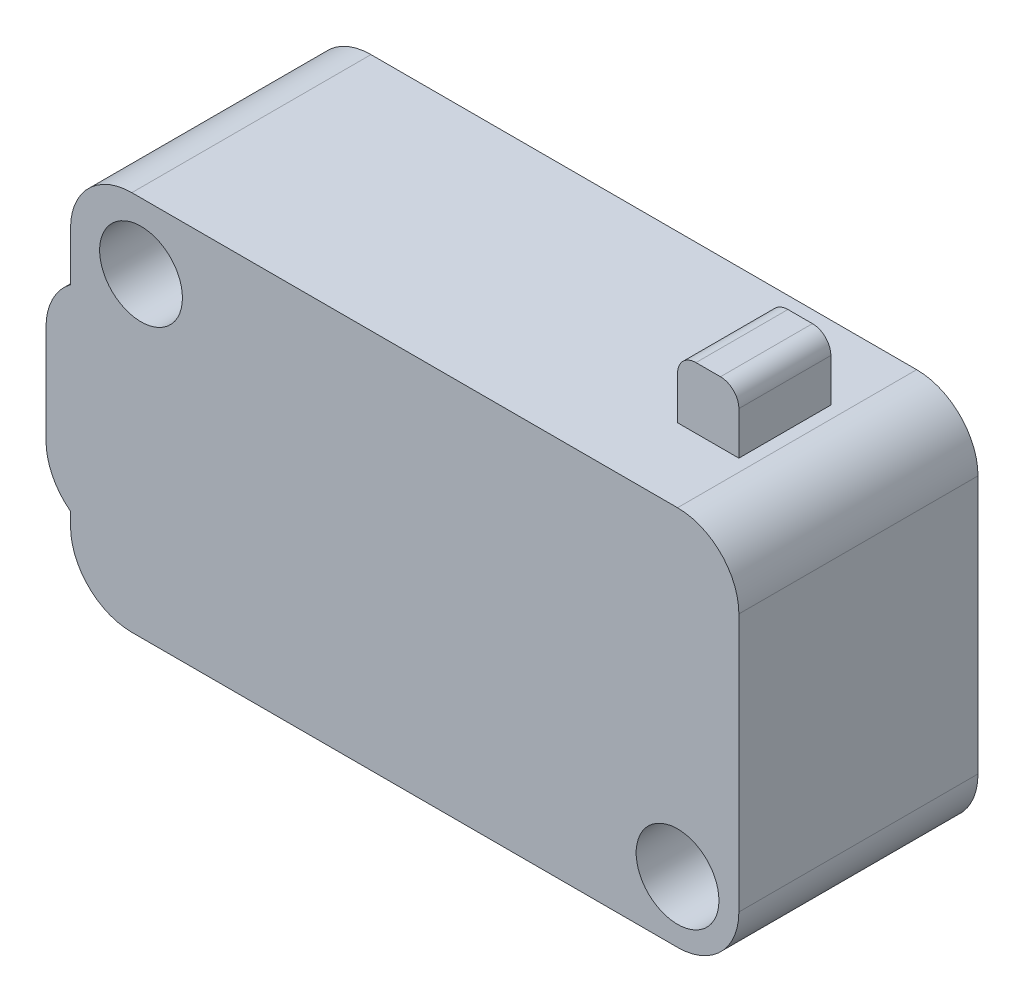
ISO-10303-21;
HEADER;
FILE_DESCRIPTION(('STEP AP214'),'2;1');
FILE_NAME('part.step','',(''),(''),'','','');
FILE_SCHEMA(('AUTOMOTIVE_DESIGN { 1 0 10303 214 1 1 1 1 }'));
ENDSEC;
DATA;
#1=APPLICATION_CONTEXT('core data for automotive mechanical design processes');
#2=APPLICATION_PROTOCOL_DEFINITION('international standard','automotive_design',2000,#1);
#3=PRODUCT_CONTEXT('',#1,'mechanical');
#4=PRODUCT('Part','Part','',(#3));
#5=PRODUCT_RELATED_PRODUCT_CATEGORY('part','',(#4));
#6=PRODUCT_DEFINITION_FORMATION('','',#4);
#7=PRODUCT_DEFINITION_CONTEXT('part definition',#1,'design');
#8=PRODUCT_DEFINITION('design','',#6,#7);
#9=PRODUCT_DEFINITION_SHAPE('','',#8);
#10=(LENGTH_UNIT() NAMED_UNIT(*) SI_UNIT(.MILLI.,.METRE.));
#11=(NAMED_UNIT(*) PLANE_ANGLE_UNIT() SI_UNIT($,.RADIAN.));
#12=(NAMED_UNIT(*) SI_UNIT($,.STERADIAN.) SOLID_ANGLE_UNIT());
#13=UNCERTAINTY_MEASURE_WITH_UNIT(LENGTH_MEASURE(1.E-05),#10,'distance_accuracy_value','');
#14=(GEOMETRIC_REPRESENTATION_CONTEXT(3) GLOBAL_UNCERTAINTY_ASSIGNED_CONTEXT((#13)) GLOBAL_UNIT_ASSIGNED_CONTEXT((#10,
#11,#12)) REPRESENTATION_CONTEXT('',''));
#15=CARTESIAN_POINT('',(0.,0.,0.));
#16=DIRECTION('',(0.,0.,1.));
#17=DIRECTION('',(1.,0.,0.));
#18=AXIS2_PLACEMENT_3D('',#15,#16,#17);
#19=CARTESIAN_POINT('',(0.,15.7734,9.906));
#20=DIRECTION('',(0.,-1.,0.));
#21=DIRECTION('',(0.,0.,-1.));
#22=AXIS2_PLACEMENT_3D('',#19,#20,#21);
#23=PLANE('',#22);
#24=DIRECTION('',(-1.,0.,0.));
#25=VECTOR('',#24,1.);
#26=CARTESIAN_POINT('',(0.,15.7734,0.));
#27=LINE('',#26,#25);
#28=CARTESIAN_POINT('',(25.146,15.7734,0.));
#29=VERTEX_POINT('',#28);
#30=CARTESIAN_POINT('',(2.54,15.7734,0.));
#31=VERTEX_POINT('',#30);
#32=EDGE_CURVE('E211',#29,#31,#27,.T.);
#33=ORIENTED_EDGE('',*,*,#32,.T.);
#34=DIRECTION('',(0.,0.,-1.));
#35=VECTOR('',#34,1.);
#36=CARTESIAN_POINT('',(2.54,15.7734,9.906));
#37=LINE('',#36,#35);
#38=CARTESIAN_POINT('',(2.54,15.7734,9.906));
#39=VERTEX_POINT('',#38);
#40=EDGE_CURVE('E261',#31,#39,#37,.F.);
#41=ORIENTED_EDGE('',*,*,#40,.T.);
#42=DIRECTION('',(-1.,0.,0.));
#43=VECTOR('',#42,1.);
#44=CARTESIAN_POINT('',(0.,15.7734,9.906));
#45=LINE('',#44,#43);
#46=CARTESIAN_POINT('',(25.146,15.7734,9.906));
#47=VERTEX_POINT('',#46);
#48=EDGE_CURVE('E229',#47,#39,#45,.T.);
#49=ORIENTED_EDGE('',*,*,#48,.F.);
#50=DIRECTION('',(0.,0.,-1.));
#51=VECTOR('',#50,1.);
#52=CARTESIAN_POINT('',(25.146,15.7734,9.906));
#53=LINE('',#52,#51);
#54=EDGE_CURVE('E258',#47,#29,#53,.T.);
#55=ORIENTED_EDGE('',*,*,#54,.T.);
#56=EDGE_LOOP('',(#33,#41,#49,#55));
#57=FACE_BOUND('',#56,.T.);
#58=DIRECTION('',(0.,0.,1.));
#59=VECTOR('',#58,1.);
#60=CARTESIAN_POINT('',(22.098,15.7734,3.048));
#61=LINE('',#60,#59);
#62=CARTESIAN_POINT('',(22.098,15.7734,3.048));
#63=VERTEX_POINT('',#62);
#64=CARTESIAN_POINT('',(22.098,15.7734,6.858));
#65=VERTEX_POINT('',#64);
#66=EDGE_CURVE('E175',#63,#65,#61,.T.);
#67=ORIENTED_EDGE('',*,*,#66,.F.);
#68=DIRECTION('',(-1.,0.,0.));
#69=VECTOR('',#68,1.);
#70=CARTESIAN_POINT('',(22.098,15.7734,3.048));
#71=LINE('',#70,#69);
#72=CARTESIAN_POINT('',(24.638,15.7734,3.048));
#73=VERTEX_POINT('',#72);
#74=EDGE_CURVE('E171',#73,#63,#71,.T.);
#75=ORIENTED_EDGE('',*,*,#74,.F.);
#76=DIRECTION('',(0.,0.,-1.));
#77=VECTOR('',#76,1.);
#78=CARTESIAN_POINT('',(24.638,15.7734,3.048));
#79=LINE('',#78,#77);
#80=CARTESIAN_POINT('',(24.638,15.7734,6.858));
#81=VERTEX_POINT('',#80);
#82=EDGE_CURVE('E156',#81,#73,#79,.T.);
#83=ORIENTED_EDGE('',*,*,#82,.F.);
#84=DIRECTION('',(1.,0.,0.));
#85=VECTOR('',#84,1.);
#86=CARTESIAN_POINT('',(22.098,15.7734,6.858));
#87=LINE('',#86,#85);
#88=EDGE_CURVE('E168',#65,#81,#87,.T.);
#89=ORIENTED_EDGE('',*,*,#88,.F.);
#90=EDGE_LOOP('',(#67,#75,#83,#89));
#91=FACE_BOUND('',#90,.T.);
#92=ADVANCED_FACE('F28',(#57,#91),#23,.F.);
#93=CARTESIAN_POINT('',(0.,3.0734,9.906));
#94=DIRECTION('',(0.,0.,-1.));
#95=DIRECTION('',(-1.,0.,0.));
#96=AXIS2_PLACEMENT_3D('',#93,#94,#95);
#97=PLANE('',#96);
#98=CARTESIAN_POINT('',(25.146,2.54,9.906));
#99=DIRECTION('',(0.,0.,1.));
#100=DIRECTION('',(1.,0.,0.));
#101=AXIS2_PLACEMENT_3D('',#98,#99,#100);
#102=CIRCLE('',#101,1.7145);
#103=CARTESIAN_POINT('',(26.8605,2.54,9.906));
#104=VERTEX_POINT('',#103);
#105=EDGE_CURVE('E199',#104,#104,#102,.T.);
#106=ORIENTED_EDGE('',*,*,#105,.F.);
#107=EDGE_LOOP('',(#106));
#108=FACE_BOUND('',#107,.T.);
#109=ORIENTED_EDGE('',*,*,#48,.T.);
#110=CARTESIAN_POINT('',(2.54,13.2334,9.906));
#111=DIRECTION('',(0.,0.,-1.));
#112=DIRECTION('',(-1.,0.,0.));
#113=AXIS2_PLACEMENT_3D('',#110,#111,#112);
#114=CIRCLE('',#113,2.54);
#115=CARTESIAN_POINT('',(0.,13.2334,9.906));
#116=VERTEX_POINT('',#115);
#117=EDGE_CURVE('E273',#39,#116,#114,.F.);
#118=ORIENTED_EDGE('',*,*,#117,.T.);
#119=DIRECTION('',(0.,-1.,0.));
#120=VECTOR('',#119,1.);
#121=CARTESIAN_POINT('',(0.,11.2014,9.906));
#122=LINE('',#121,#120);
#123=CARTESIAN_POINT('',(0.,11.2014,9.906));
#124=VERTEX_POINT('',#123);
#125=EDGE_CURVE('E232',#116,#124,#122,.T.);
#126=ORIENTED_EDGE('',*,*,#125,.T.);
#127=CARTESIAN_POINT('',(1.52400000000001,9.16940000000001,9.906));
#128=DIRECTION('',(0.,0.,-1.));
#129=DIRECTION('',(-1.,0.,0.));
#130=AXIS2_PLACEMENT_3D('',#127,#128,#129);
#131=CIRCLE('',#130,2.54);
#132=CARTESIAN_POINT('',(-1.01599999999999,9.16940000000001,9.906));
#133=VERTEX_POINT('',#132);
#134=EDGE_CURVE('E263',#124,#133,#131,.F.);
#135=ORIENTED_EDGE('',*,*,#134,.T.);
#136=DIRECTION('',(0.,-1.,0.));
#137=VECTOR('',#136,1.);
#138=CARTESIAN_POINT('',(-1.01599999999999,11.2014,9.906));
#139=LINE('',#138,#137);
#140=CARTESIAN_POINT('',(-1.01599999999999,5.10539999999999,9.906));
#141=VERTEX_POINT('',#140);
#142=EDGE_CURVE('E234',#133,#141,#139,.T.);
#143=ORIENTED_EDGE('',*,*,#142,.T.);
#144=CARTESIAN_POINT('',(1.52400000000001,5.10539999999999,9.906));
#145=DIRECTION('',(0.,0.,-1.));
#146=DIRECTION('',(-1.,0.,0.));
#147=AXIS2_PLACEMENT_3D('',#144,#145,#146);
#148=CIRCLE('',#147,2.54);
#149=CARTESIAN_POINT('',(0.,3.0734,9.906));
#150=VERTEX_POINT('',#149);
#151=EDGE_CURVE('E265',#141,#150,#148,.F.);
#152=ORIENTED_EDGE('',*,*,#151,.T.);
#153=DIRECTION('',(0.,-1.,0.));
#154=VECTOR('',#153,1.);
#155=CARTESIAN_POINT('',(0.,0.,9.906));
#156=LINE('',#155,#154);
#157=CARTESIAN_POINT('',(0.,2.54,9.906));
#158=VERTEX_POINT('',#157);
#159=EDGE_CURVE('E220',#150,#158,#156,.T.);
#160=ORIENTED_EDGE('',*,*,#159,.T.);
#161=CARTESIAN_POINT('',(2.54,2.54,9.906));
#162=DIRECTION('',(0.,0.,-1.));
#163=DIRECTION('',(-1.,0.,0.));
#164=AXIS2_PLACEMENT_3D('',#161,#162,#163);
#165=CIRCLE('',#164,2.54);
#166=CARTESIAN_POINT('',(2.54,0.,9.906));
#167=VERTEX_POINT('',#166);
#168=EDGE_CURVE('E267',#158,#167,#165,.F.);
#169=ORIENTED_EDGE('',*,*,#168,.T.);
#170=DIRECTION('',(1.,0.,0.));
#171=VECTOR('',#170,1.);
#172=CARTESIAN_POINT('',(0.,0.,9.906));
#173=LINE('',#172,#171);
#174=CARTESIAN_POINT('',(25.146,0.,9.906));
#175=VERTEX_POINT('',#174);
#176=EDGE_CURVE('E223',#167,#175,#173,.T.);
#177=ORIENTED_EDGE('',*,*,#176,.T.);
#178=CARTESIAN_POINT('',(25.146,2.54,9.906));
#179=DIRECTION('',(0.,0.,-1.));
#180=DIRECTION('',(-1.,0.,0.));
#181=AXIS2_PLACEMENT_3D('',#178,#179,#180);
#182=CIRCLE('',#181,2.54);
#183=CARTESIAN_POINT('',(27.686,2.54,9.906));
#184=VERTEX_POINT('',#183);
#185=EDGE_CURVE('E269',#175,#184,#182,.F.);
#186=ORIENTED_EDGE('',*,*,#185,.T.);
#187=DIRECTION('',(0.,1.,0.));
#188=VECTOR('',#187,1.);
#189=CARTESIAN_POINT('',(27.686,0.,9.906));
#190=LINE('',#189,#188);
#191=CARTESIAN_POINT('',(27.686,13.2334,9.906));
#192=VERTEX_POINT('',#191);
#193=EDGE_CURVE('E226',#184,#192,#190,.T.);
#194=ORIENTED_EDGE('',*,*,#193,.T.);
#195=CARTESIAN_POINT('',(25.146,13.2334,9.906));
#196=DIRECTION('',(0.,0.,-1.));
#197=DIRECTION('',(-1.,0.,0.));
#198=AXIS2_PLACEMENT_3D('',#195,#196,#197);
#199=CIRCLE('',#198,2.54);
#200=EDGE_CURVE('E271',#192,#47,#199,.F.);
#201=ORIENTED_EDGE('',*,*,#200,.T.);
#202=EDGE_LOOP('',(#109,#118,#126,#135,#143,#152,#160,#169,#177,#186,#194,#201));
#203=FACE_BOUND('',#202,.T.);
#204=CARTESIAN_POINT('',(2.92100000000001,13.0429,9.906));
#205=DIRECTION('',(0.,0.,1.));
#206=DIRECTION('',(1.,0.,0.));
#207=AXIS2_PLACEMENT_3D('',#204,#205,#206);
#208=CIRCLE('',#207,1.7145);
#209=CARTESIAN_POINT('',(4.6355,13.0429,9.906));
#210=VERTEX_POINT('',#209);
#211=EDGE_CURVE('E193',#210,#210,#208,.T.);
#212=ORIENTED_EDGE('',*,*,#211,.F.);
#213=EDGE_LOOP('',(#212));
#214=FACE_BOUND('',#213,.T.);
#215=ADVANCED_FACE('F321',(#108,#203,#214),#97,.F.);
#216=CARTESIAN_POINT('',(0.,3.0734,0.));
#217=DIRECTION('',(0.,0.,-1.));
#218=DIRECTION('',(-1.,0.,0.));
#219=AXIS2_PLACEMENT_3D('',#216,#217,#218);
#220=PLANE('',#219);
#221=CARTESIAN_POINT('',(25.146,2.54,0.));
#222=DIRECTION('',(0.,0.,1.));
#223=DIRECTION('',(1.,0.,0.));
#224=AXIS2_PLACEMENT_3D('',#221,#222,#223);
#225=CIRCLE('',#224,1.7145);
#226=CARTESIAN_POINT('',(26.8605,2.54,0.));
#227=VERTEX_POINT('',#226);
#228=EDGE_CURVE('E196',#227,#227,#225,.T.);
#229=ORIENTED_EDGE('',*,*,#228,.T.);
#230=EDGE_LOOP('',(#229));
#231=FACE_BOUND('',#230,.T.);
#232=DIRECTION('',(0.,-1.,0.));
#233=VECTOR('',#232,1.);
#234=CARTESIAN_POINT('',(0.,11.2014,0.));
#235=LINE('',#234,#233);
#236=CARTESIAN_POINT('',(0.,13.2334,0.));
#237=VERTEX_POINT('',#236);
#238=CARTESIAN_POINT('',(0.,11.2014,0.));
#239=VERTEX_POINT('',#238);
#240=EDGE_CURVE('E214',#237,#239,#235,.T.);
#241=ORIENTED_EDGE('',*,*,#240,.F.);
#242=CARTESIAN_POINT('',(2.54,13.2334,0.));
#243=DIRECTION('',(0.,0.,-1.));
#244=DIRECTION('',(-1.,0.,0.));
#245=AXIS2_PLACEMENT_3D('',#242,#243,#244);
#246=CIRCLE('',#245,2.54);
#247=EDGE_CURVE('E256',#237,#31,#246,.T.);
#248=ORIENTED_EDGE('',*,*,#247,.T.);
#249=ORIENTED_EDGE('',*,*,#32,.F.);
#250=CARTESIAN_POINT('',(25.146,13.2334,0.));
#251=DIRECTION('',(0.,0.,-1.));
#252=DIRECTION('',(-1.,0.,0.));
#253=AXIS2_PLACEMENT_3D('',#250,#251,#252);
#254=CIRCLE('',#253,2.54);
#255=CARTESIAN_POINT('',(27.686,13.2334,0.));
#256=VERTEX_POINT('',#255);
#257=EDGE_CURVE('E254',#29,#256,#254,.T.);
#258=ORIENTED_EDGE('',*,*,#257,.T.);
#259=DIRECTION('',(0.,1.,0.));
#260=VECTOR('',#259,1.);
#261=CARTESIAN_POINT('',(27.686,0.,0.));
#262=LINE('',#261,#260);
#263=CARTESIAN_POINT('',(27.686,2.54,0.));
#264=VERTEX_POINT('',#263);
#265=EDGE_CURVE('E208',#264,#256,#262,.T.);
#266=ORIENTED_EDGE('',*,*,#265,.F.);
#267=CARTESIAN_POINT('',(25.146,2.54,0.));
#268=DIRECTION('',(0.,0.,-1.));
#269=DIRECTION('',(-1.,0.,0.));
#270=AXIS2_PLACEMENT_3D('',#267,#268,#269);
#271=CIRCLE('',#270,2.54);
#272=CARTESIAN_POINT('',(25.146,0.,0.));
#273=VERTEX_POINT('',#272);
#274=EDGE_CURVE('E252',#264,#273,#271,.T.);
#275=ORIENTED_EDGE('',*,*,#274,.T.);
#276=DIRECTION('',(1.,0.,0.));
#277=VECTOR('',#276,1.);
#278=CARTESIAN_POINT('',(0.,0.,0.));
#279=LINE('',#278,#277);
#280=CARTESIAN_POINT('',(2.54,0.,0.));
#281=VERTEX_POINT('',#280);
#282=EDGE_CURVE('E205',#281,#273,#279,.T.);
#283=ORIENTED_EDGE('',*,*,#282,.F.);
#284=CARTESIAN_POINT('',(2.54,2.54,0.));
#285=DIRECTION('',(0.,0.,-1.));
#286=DIRECTION('',(-1.,0.,0.));
#287=AXIS2_PLACEMENT_3D('',#284,#285,#286);
#288=CIRCLE('',#287,2.54);
#289=CARTESIAN_POINT('',(0.,2.54,0.));
#290=VERTEX_POINT('',#289);
#291=EDGE_CURVE('E250',#281,#290,#288,.T.);
#292=ORIENTED_EDGE('',*,*,#291,.T.);
#293=DIRECTION('',(0.,-1.,0.));
#294=VECTOR('',#293,1.);
#295=CARTESIAN_POINT('',(0.,0.,0.));
#296=LINE('',#295,#294);
#297=CARTESIAN_POINT('',(0.,3.0734,0.));
#298=VERTEX_POINT('',#297);
#299=EDGE_CURVE('E202',#298,#290,#296,.T.);
#300=ORIENTED_EDGE('',*,*,#299,.F.);
#301=CARTESIAN_POINT('',(1.52400000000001,5.10539999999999,0.));
#302=DIRECTION('',(0.,0.,-1.));
#303=DIRECTION('',(-1.,0.,0.));
#304=AXIS2_PLACEMENT_3D('',#301,#302,#303);
#305=CIRCLE('',#304,2.54);
#306=CARTESIAN_POINT('',(-1.01599999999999,5.10539999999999,0.));
#307=VERTEX_POINT('',#306);
#308=EDGE_CURVE('E248',#298,#307,#305,.T.);
#309=ORIENTED_EDGE('',*,*,#308,.T.);
#310=DIRECTION('',(0.,-1.,0.));
#311=VECTOR('',#310,1.);
#312=CARTESIAN_POINT('',(-1.01599999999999,11.2014,0.));
#313=LINE('',#312,#311);
#314=CARTESIAN_POINT('',(-1.01599999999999,9.16940000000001,0.));
#315=VERTEX_POINT('',#314);
#316=EDGE_CURVE('E217',#315,#307,#313,.T.);
#317=ORIENTED_EDGE('',*,*,#316,.F.);
#318=CARTESIAN_POINT('',(1.52400000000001,9.16940000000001,0.));
#319=DIRECTION('',(0.,0.,-1.));
#320=DIRECTION('',(-1.,0.,0.));
#321=AXIS2_PLACEMENT_3D('',#318,#319,#320);
#322=CIRCLE('',#321,2.54);
#323=EDGE_CURVE('E246',#315,#239,#322,.T.);
#324=ORIENTED_EDGE('',*,*,#323,.T.);
#325=EDGE_LOOP('',(#241,#248,#249,#258,#266,#275,#283,#292,#300,#309,#317,#324));
#326=FACE_BOUND('',#325,.T.);
#327=CARTESIAN_POINT('',(2.92100000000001,13.0429,0.));
#328=DIRECTION('',(0.,0.,1.));
#329=DIRECTION('',(1.,0.,0.));
#330=AXIS2_PLACEMENT_3D('',#327,#328,#329);
#331=CIRCLE('',#330,1.7145);
#332=CARTESIAN_POINT('',(4.6355,13.0429,0.));
#333=VERTEX_POINT('',#332);
#334=EDGE_CURVE('E190',#333,#333,#331,.T.);
#335=ORIENTED_EDGE('',*,*,#334,.T.);
#336=EDGE_LOOP('',(#335));
#337=FACE_BOUND('',#336,.T.);
#338=ADVANCED_FACE('F327',(#231,#326,#337),#220,.T.);
#339=CARTESIAN_POINT('',(0.,0.,9.906));
#340=DIRECTION('',(1.,0.,0.));
#341=DIRECTION('',(0.,0.,-1.));
#342=AXIS2_PLACEMENT_3D('',#339,#340,#341);
#343=PLANE('',#342);
#344=ORIENTED_EDGE('',*,*,#299,.T.);
#345=DIRECTION('',(0.,0.,-1.));
#346=VECTOR('',#345,1.);
#347=CARTESIAN_POINT('',(0.,2.54,9.906));
#348=LINE('',#347,#346);
#349=EDGE_CURVE('E285',#290,#158,#348,.F.);
#350=ORIENTED_EDGE('',*,*,#349,.T.);
#351=ORIENTED_EDGE('',*,*,#159,.F.);
#352=DIRECTION('',(0.,0.,-1.));
#353=VECTOR('',#352,1.);
#354=CARTESIAN_POINT('',(0.,3.0734,9.906));
#355=LINE('',#354,#353);
#356=EDGE_CURVE('E237',#150,#298,#355,.T.);
#357=ORIENTED_EDGE('',*,*,#356,.T.);
#358=EDGE_LOOP('',(#344,#350,#351,#357));
#359=FACE_BOUND('',#358,.T.);
#360=ADVANCED_FACE('F30',(#359),#343,.F.);
#361=CARTESIAN_POINT('',(0.,0.,9.906));
#362=DIRECTION('',(0.,1.,0.));
#363=DIRECTION('',(0.,0.,1.));
#364=AXIS2_PLACEMENT_3D('',#361,#362,#363);
#365=PLANE('',#364);
#366=ORIENTED_EDGE('',*,*,#282,.T.);
#367=DIRECTION('',(0.,0.,-1.));
#368=VECTOR('',#367,1.);
#369=CARTESIAN_POINT('',(25.146,0.,9.906));
#370=LINE('',#369,#368);
#371=EDGE_CURVE('E283',#273,#175,#370,.F.);
#372=ORIENTED_EDGE('',*,*,#371,.T.);
#373=ORIENTED_EDGE('',*,*,#176,.F.);
#374=DIRECTION('',(0.,0.,-1.));
#375=VECTOR('',#374,1.);
#376=CARTESIAN_POINT('',(2.54,0.,9.906));
#377=LINE('',#376,#375);
#378=EDGE_CURVE('E280',#167,#281,#377,.T.);
#379=ORIENTED_EDGE('',*,*,#378,.T.);
#380=EDGE_LOOP('',(#366,#372,#373,#379));
#381=FACE_BOUND('',#380,.T.);
#382=ADVANCED_FACE('F336',(#381),#365,.F.);
#383=CARTESIAN_POINT('',(27.686,0.,9.906));
#384=DIRECTION('',(-1.,0.,0.));
#385=DIRECTION('',(0.,0.,1.));
#386=AXIS2_PLACEMENT_3D('',#383,#384,#385);
#387=PLANE('',#386);
#388=ORIENTED_EDGE('',*,*,#265,.T.);
#389=DIRECTION('',(0.,0.,-1.));
#390=VECTOR('',#389,1.);
#391=CARTESIAN_POINT('',(27.686,13.2334,9.906));
#392=LINE('',#391,#390);
#393=EDGE_CURVE('E278',#256,#192,#392,.F.);
#394=ORIENTED_EDGE('',*,*,#393,.T.);
#395=ORIENTED_EDGE('',*,*,#193,.F.);
#396=DIRECTION('',(0.,0.,-1.));
#397=VECTOR('',#396,1.);
#398=CARTESIAN_POINT('',(27.686,2.54,9.906));
#399=LINE('',#398,#397);
#400=EDGE_CURVE('E275',#184,#264,#399,.T.);
#401=ORIENTED_EDGE('',*,*,#400,.T.);
#402=EDGE_LOOP('',(#388,#394,#395,#401));
#403=FACE_BOUND('',#402,.T.);
#404=ADVANCED_FACE('F334',(#403),#387,.F.);
#405=CARTESIAN_POINT('',(0.,11.2014,9.906));
#406=DIRECTION('',(1.,0.,0.));
#407=DIRECTION('',(0.,0.,-1.));
#408=AXIS2_PLACEMENT_3D('',#405,#406,#407);
#409=PLANE('',#408);
#410=ORIENTED_EDGE('',*,*,#125,.F.);
#411=DIRECTION('',(0.,0.,-1.));
#412=VECTOR('',#411,1.);
#413=CARTESIAN_POINT('',(0.,13.2334,9.906));
#414=LINE('',#413,#412);
#415=EDGE_CURVE('E243',#116,#237,#414,.T.);
#416=ORIENTED_EDGE('',*,*,#415,.T.);
#417=ORIENTED_EDGE('',*,*,#240,.T.);
#418=DIRECTION('',(0.,0.,-1.));
#419=VECTOR('',#418,1.);
#420=CARTESIAN_POINT('',(0.,11.2014,9.906));
#421=LINE('',#420,#419);
#422=EDGE_CURVE('E240',#124,#239,#421,.T.);
#423=ORIENTED_EDGE('',*,*,#422,.F.);
#424=EDGE_LOOP('',(#410,#416,#417,#423));
#425=FACE_BOUND('',#424,.T.);
#426=ADVANCED_FACE('F332',(#425),#409,.F.);
#427=CARTESIAN_POINT('',(-1.01599999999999,11.2014,9.906));
#428=DIRECTION('',(1.,0.,0.));
#429=DIRECTION('',(0.,1.,0.));
#430=AXIS2_PLACEMENT_3D('',#427,#428,#429);
#431=PLANE('',#430);
#432=ORIENTED_EDGE('',*,*,#316,.T.);
#433=DIRECTION('',(0.,0.,-1.));
#434=VECTOR('',#433,1.);
#435=CARTESIAN_POINT('',(-1.01599999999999,5.10539999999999,9.906));
#436=LINE('',#435,#434);
#437=EDGE_CURVE('E290',#307,#141,#436,.F.);
#438=ORIENTED_EDGE('',*,*,#437,.T.);
#439=ORIENTED_EDGE('',*,*,#142,.F.);
#440=DIRECTION('',(0.,0.,1.));
#441=VECTOR('',#440,1.);
#442=CARTESIAN_POINT('',(-1.01599999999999,9.16940000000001,9.906));
#443=LINE('',#442,#441);
#444=EDGE_CURVE('E287',#133,#315,#443,.F.);
#445=ORIENTED_EDGE('',*,*,#444,.T.);
#446=EDGE_LOOP('',(#432,#438,#439,#445));
#447=FACE_BOUND('',#446,.T.);
#448=ADVANCED_FACE('F380',(#447),#431,.F.);
#449=CARTESIAN_POINT('',(25.146,2.54,9.906));
#450=DIRECTION('',(0.,0.,-1.));
#451=DIRECTION('',(-1.,0.,0.));
#452=AXIS2_PLACEMENT_3D('',#449,#450,#451);
#453=CYLINDRICAL_SURFACE('',#452,1.7145);
#454=ORIENTED_EDGE('',*,*,#105,.T.);
#455=EDGE_LOOP('',(#454));
#456=FACE_BOUND('',#455,.T.);
#457=ORIENTED_EDGE('',*,*,#228,.F.);
#458=EDGE_LOOP('',(#457));
#459=FACE_BOUND('',#458,.T.);
#460=ADVANCED_FACE('F400',(#456,#459),#453,.F.);
#461=CARTESIAN_POINT('',(2.92100000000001,13.0429,9.906));
#462=DIRECTION('',(0.,0.,-1.));
#463=DIRECTION('',(-1.,0.,0.));
#464=AXIS2_PLACEMENT_3D('',#461,#462,#463);
#465=CYLINDRICAL_SURFACE('',#464,1.7145);
#466=ORIENTED_EDGE('',*,*,#211,.T.);
#467=EDGE_LOOP('',(#466));
#468=FACE_BOUND('',#467,.T.);
#469=ORIENTED_EDGE('',*,*,#334,.F.);
#470=EDGE_LOOP('',(#469));
#471=FACE_BOUND('',#470,.T.);
#472=ADVANCED_FACE('F398',(#468,#471),#465,.F.);
#473=CARTESIAN_POINT('',(2.54,13.2334,9.906));
#474=DIRECTION('',(0.,0.,-1.));
#475=DIRECTION('',(-1.,0.,0.));
#476=AXIS2_PLACEMENT_3D('',#473,#474,#475);
#477=CYLINDRICAL_SURFACE('',#476,2.54);
#478=ORIENTED_EDGE('',*,*,#117,.F.);
#479=ORIENTED_EDGE('',*,*,#40,.F.);
#480=ORIENTED_EDGE('',*,*,#247,.F.);
#481=ORIENTED_EDGE('',*,*,#415,.F.);
#482=EDGE_LOOP('',(#478,#479,#480,#481));
#483=FACE_BOUND('',#482,.T.);
#484=ADVANCED_FACE('F367',(#483),#477,.T.);
#485=CARTESIAN_POINT('',(25.146,13.2334,9.906));
#486=DIRECTION('',(0.,0.,-1.));
#487=DIRECTION('',(-1.,0.,0.));
#488=AXIS2_PLACEMENT_3D('',#485,#486,#487);
#489=CYLINDRICAL_SURFACE('',#488,2.54);
#490=ORIENTED_EDGE('',*,*,#200,.F.);
#491=ORIENTED_EDGE('',*,*,#393,.F.);
#492=ORIENTED_EDGE('',*,*,#257,.F.);
#493=ORIENTED_EDGE('',*,*,#54,.F.);
#494=EDGE_LOOP('',(#490,#491,#492,#493));
#495=FACE_BOUND('',#494,.T.);
#496=ADVANCED_FACE('F360',(#495),#489,.T.);
#497=CARTESIAN_POINT('',(25.146,2.54,9.906));
#498=DIRECTION('',(0.,0.,-1.));
#499=DIRECTION('',(-1.,0.,0.));
#500=AXIS2_PLACEMENT_3D('',#497,#498,#499);
#501=CYLINDRICAL_SURFACE('',#500,2.54);
#502=ORIENTED_EDGE('',*,*,#185,.F.);
#503=ORIENTED_EDGE('',*,*,#371,.F.);
#504=ORIENTED_EDGE('',*,*,#274,.F.);
#505=ORIENTED_EDGE('',*,*,#400,.F.);
#506=EDGE_LOOP('',(#502,#503,#504,#505));
#507=FACE_BOUND('',#506,.T.);
#508=ADVANCED_FACE('F351',(#507),#501,.T.);
#509=CARTESIAN_POINT('',(2.54,2.54,9.906));
#510=DIRECTION('',(0.,0.,-1.));
#511=DIRECTION('',(-1.,0.,0.));
#512=AXIS2_PLACEMENT_3D('',#509,#510,#511);
#513=CYLINDRICAL_SURFACE('',#512,2.54);
#514=ORIENTED_EDGE('',*,*,#168,.F.);
#515=ORIENTED_EDGE('',*,*,#349,.F.);
#516=ORIENTED_EDGE('',*,*,#291,.F.);
#517=ORIENTED_EDGE('',*,*,#378,.F.);
#518=EDGE_LOOP('',(#514,#515,#516,#517));
#519=FACE_BOUND('',#518,.T.);
#520=ADVANCED_FACE('F391',(#519),#513,.T.);
#521=CARTESIAN_POINT('',(1.52400000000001,5.10539999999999,9.906));
#522=DIRECTION('',(0.,0.,-1.));
#523=DIRECTION('',(-1.,0.,0.));
#524=AXIS2_PLACEMENT_3D('',#521,#522,#523);
#525=CYLINDRICAL_SURFACE('',#524,2.54);
#526=ORIENTED_EDGE('',*,*,#151,.F.);
#527=ORIENTED_EDGE('',*,*,#437,.F.);
#528=ORIENTED_EDGE('',*,*,#308,.F.);
#529=ORIENTED_EDGE('',*,*,#356,.F.);
#530=EDGE_LOOP('',(#526,#527,#528,#529));
#531=FACE_BOUND('',#530,.T.);
#532=ADVANCED_FACE('F384',(#531),#525,.T.);
#533=CARTESIAN_POINT('',(1.52400000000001,9.16940000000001,9.906));
#534=DIRECTION('',(0.,0.,1.));
#535=DIRECTION('',(1.,0.,0.));
#536=AXIS2_PLACEMENT_3D('',#533,#534,#535);
#537=CYLINDRICAL_SURFACE('',#536,2.54);
#538=ORIENTED_EDGE('',*,*,#134,.F.);
#539=ORIENTED_EDGE('',*,*,#422,.T.);
#540=ORIENTED_EDGE('',*,*,#323,.F.);
#541=ORIENTED_EDGE('',*,*,#444,.F.);
#542=EDGE_LOOP('',(#538,#539,#540,#541));
#543=FACE_BOUND('',#542,.T.);
#544=ADVANCED_FACE('F376',(#543),#537,.T.);
#545=CARTESIAN_POINT('',(22.098,18.3134,3.048));
#546=DIRECTION('',(1.,0.,0.));
#547=DIRECTION('',(0.,0.,-1.));
#548=AXIS2_PLACEMENT_3D('',#545,#546,#547);
#549=PLANE('',#548);
#550=DIRECTION('',(0.,-1.,0.));
#551=VECTOR('',#550,1.);
#552=CARTESIAN_POINT('',(22.098,18.3134,6.858));
#553=LINE('',#552,#551);
#554=CARTESIAN_POINT('',(22.098,17.5514,6.858));
#555=VERTEX_POINT('',#554);
#556=EDGE_CURVE('E161',#555,#65,#553,.T.);
#557=ORIENTED_EDGE('',*,*,#556,.F.);
#558=DIRECTION('',(0.,0.,1.));
#559=VECTOR('',#558,1.);
#560=CARTESIAN_POINT('',(22.098,17.5514,6.858));
#561=LINE('',#560,#559);
#562=CARTESIAN_POINT('',(22.098,17.5514,3.048));
#563=VERTEX_POINT('',#562);
#564=EDGE_CURVE('E51',#555,#563,#561,.F.);
#565=ORIENTED_EDGE('',*,*,#564,.T.);
#566=DIRECTION('',(0.,-1.,0.));
#567=VECTOR('',#566,1.);
#568=CARTESIAN_POINT('',(22.098,18.3134,3.048));
#569=LINE('',#568,#567);
#570=EDGE_CURVE('E186',#563,#63,#569,.T.);
#571=ORIENTED_EDGE('',*,*,#570,.T.);
#572=ORIENTED_EDGE('',*,*,#66,.T.);
#573=EDGE_LOOP('',(#557,#565,#571,#572));
#574=FACE_BOUND('',#573,.T.);
#575=ADVANCED_FACE('F311',(#574),#549,.F.);
#576=CARTESIAN_POINT('',(22.098,18.3134,6.858));
#577=DIRECTION('',(0.,0.,-1.));
#578=DIRECTION('',(-1.,0.,0.));
#579=AXIS2_PLACEMENT_3D('',#576,#577,#578);
#580=PLANE('',#579);
#581=DIRECTION('',(1.,0.,0.));
#582=VECTOR('',#581,1.);
#583=CARTESIAN_POINT('',(22.098,18.3134,6.858));
#584=LINE('',#583,#582);
#585=CARTESIAN_POINT('',(22.86,18.3134,6.858));
#586=VERTEX_POINT('',#585);
#587=CARTESIAN_POINT('',(23.876,18.3134,6.858));
#588=VERTEX_POINT('',#587);
#589=EDGE_CURVE('E180',#586,#588,#584,.T.);
#590=ORIENTED_EDGE('',*,*,#589,.F.);
#591=CARTESIAN_POINT('',(22.86,17.5514,6.858));
#592=DIRECTION('',(0.,0.,-1.));
#593=DIRECTION('',(-1.,0.,0.));
#594=AXIS2_PLACEMENT_3D('',#591,#592,#593);
#595=CIRCLE('',#594,0.762);
#596=EDGE_CURVE('E300',#586,#555,#595,.F.);
#597=ORIENTED_EDGE('',*,*,#596,.T.);
#598=ORIENTED_EDGE('',*,*,#556,.T.);
#599=ORIENTED_EDGE('',*,*,#88,.T.);
#600=DIRECTION('',(0.,-1.,0.));
#601=VECTOR('',#600,1.);
#602=CARTESIAN_POINT('',(24.638,18.3134,6.858));
#603=LINE('',#602,#601);
#604=CARTESIAN_POINT('',(24.638,17.5514,6.858));
#605=VERTEX_POINT('',#604);
#606=EDGE_CURVE('E153',#605,#81,#603,.T.);
#607=ORIENTED_EDGE('',*,*,#606,.F.);
#608=CARTESIAN_POINT('',(23.876,17.5514,6.858));
#609=DIRECTION('',(0.,0.,-1.));
#610=DIRECTION('',(-1.,0.,0.));
#611=AXIS2_PLACEMENT_3D('',#608,#609,#610);
#612=CIRCLE('',#611,0.762);
#613=EDGE_CURVE('E298',#605,#588,#612,.F.);
#614=ORIENTED_EDGE('',*,*,#613,.T.);
#615=EDGE_LOOP('',(#590,#597,#598,#599,#607,#614));
#616=FACE_BOUND('',#615,.T.);
#617=ADVANCED_FACE('F174',(#616),#580,.F.);
#618=CARTESIAN_POINT('',(24.638,18.3134,3.048));
#619=DIRECTION('',(-1.,0.,0.));
#620=DIRECTION('',(0.,0.,1.));
#621=AXIS2_PLACEMENT_3D('',#618,#619,#620);
#622=PLANE('',#621);
#623=DIRECTION('',(0.,-1.,0.));
#624=VECTOR('',#623,1.);
#625=CARTESIAN_POINT('',(24.638,18.3134,3.048));
#626=LINE('',#625,#624);
#627=CARTESIAN_POINT('',(24.638,17.5514,3.048));
#628=VERTEX_POINT('',#627);
#629=EDGE_CURVE('E162',#628,#73,#626,.T.);
#630=ORIENTED_EDGE('',*,*,#629,.F.);
#631=DIRECTION('',(0.,0.,-1.));
#632=VECTOR('',#631,1.);
#633=CARTESIAN_POINT('',(24.638,17.5514,6.858));
#634=LINE('',#633,#632);
#635=EDGE_CURVE('E11',#628,#605,#634,.F.);
#636=ORIENTED_EDGE('',*,*,#635,.T.);
#637=ORIENTED_EDGE('',*,*,#606,.T.);
#638=ORIENTED_EDGE('',*,*,#82,.T.);
#639=EDGE_LOOP('',(#630,#636,#637,#638));
#640=FACE_BOUND('',#639,.T.);
#641=ADVANCED_FACE('F155',(#640),#622,.F.);
#642=CARTESIAN_POINT('',(22.098,18.3134,3.048));
#643=DIRECTION('',(0.,0.,1.));
#644=DIRECTION('',(1.,0.,0.));
#645=AXIS2_PLACEMENT_3D('',#642,#643,#644);
#646=PLANE('',#645);
#647=ORIENTED_EDGE('',*,*,#570,.F.);
#648=CARTESIAN_POINT('',(22.86,17.5514,3.048));
#649=DIRECTION('',(0.,0.,1.));
#650=DIRECTION('',(1.,0.,0.));
#651=AXIS2_PLACEMENT_3D('',#648,#649,#650);
#652=CIRCLE('',#651,0.762);
#653=CARTESIAN_POINT('',(22.86,18.3134,3.048));
#654=VERTEX_POINT('',#653);
#655=EDGE_CURVE('E36',#563,#654,#652,.F.);
#656=ORIENTED_EDGE('',*,*,#655,.T.);
#657=DIRECTION('',(-1.,0.,0.));
#658=VECTOR('',#657,1.);
#659=CARTESIAN_POINT('',(22.098,18.3134,3.048));
#660=LINE('',#659,#658);
#661=CARTESIAN_POINT('',(23.876,18.3134,3.048));
#662=VERTEX_POINT('',#661);
#663=EDGE_CURVE('E183',#662,#654,#660,.T.);
#664=ORIENTED_EDGE('',*,*,#663,.F.);
#665=CARTESIAN_POINT('',(23.876,17.5514,3.048));
#666=DIRECTION('',(0.,0.,1.));
#667=DIRECTION('',(1.,0.,0.));
#668=AXIS2_PLACEMENT_3D('',#665,#666,#667);
#669=CIRCLE('',#668,0.762);
#670=EDGE_CURVE('E43',#662,#628,#669,.F.);
#671=ORIENTED_EDGE('',*,*,#670,.T.);
#672=ORIENTED_EDGE('',*,*,#629,.T.);
#673=ORIENTED_EDGE('',*,*,#74,.T.);
#674=EDGE_LOOP('',(#647,#656,#664,#671,#672,#673));
#675=FACE_BOUND('',#674,.T.);
#676=ADVANCED_FACE('F304',(#675),#646,.F.);
#677=CARTESIAN_POINT('',(22.098,18.3134,6.858));
#678=DIRECTION('',(0.,1.,0.));
#679=DIRECTION('',(0.,0.,1.));
#680=AXIS2_PLACEMENT_3D('',#677,#678,#679);
#681=PLANE('',#680);
#682=ORIENTED_EDGE('',*,*,#663,.T.);
#683=DIRECTION('',(0.,0.,1.));
#684=VECTOR('',#683,1.);
#685=CARTESIAN_POINT('',(22.86,18.3134,6.858));
#686=LINE('',#685,#684);
#687=EDGE_CURVE('E295',#654,#586,#686,.T.);
#688=ORIENTED_EDGE('',*,*,#687,.T.);
#689=ORIENTED_EDGE('',*,*,#589,.T.);
#690=DIRECTION('',(0.,0.,-1.));
#691=VECTOR('',#690,1.);
#692=CARTESIAN_POINT('',(23.876,18.3134,6.858));
#693=LINE('',#692,#691);
#694=EDGE_CURVE('E292',#588,#662,#693,.T.);
#695=ORIENTED_EDGE('',*,*,#694,.T.);
#696=EDGE_LOOP('',(#682,#688,#689,#695));
#697=FACE_BOUND('',#696,.T.);
#698=ADVANCED_FACE('F308',(#697),#681,.T.);
#699=CARTESIAN_POINT('',(22.86,17.5514,6.858));
#700=DIRECTION('',(0.,0.,-1.));
#701=DIRECTION('',(-1.,0.,0.));
#702=AXIS2_PLACEMENT_3D('',#699,#700,#701);
#703=CYLINDRICAL_SURFACE('',#702,0.762);
#704=ORIENTED_EDGE('',*,*,#655,.F.);
#705=ORIENTED_EDGE('',*,*,#564,.F.);
#706=ORIENTED_EDGE('',*,*,#596,.F.);
#707=ORIENTED_EDGE('',*,*,#687,.F.);
#708=EDGE_LOOP('',(#704,#705,#706,#707));
#709=FACE_BOUND('',#708,.T.);
#710=ADVANCED_FACE('F310',(#709),#703,.T.);
#711=CARTESIAN_POINT('',(23.876,17.5514,6.858));
#712=DIRECTION('',(0.,0.,1.));
#713=DIRECTION('',(1.,0.,0.));
#714=AXIS2_PLACEMENT_3D('',#711,#712,#713);
#715=CYLINDRICAL_SURFACE('',#714,0.762);
#716=ORIENTED_EDGE('',*,*,#613,.F.);
#717=ORIENTED_EDGE('',*,*,#635,.F.);
#718=ORIENTED_EDGE('',*,*,#670,.F.);
#719=ORIENTED_EDGE('',*,*,#694,.F.);
#720=EDGE_LOOP('',(#716,#717,#718,#719));
#721=FACE_BOUND('',#720,.T.);
#722=ADVANCED_FACE('F313',(#721),#715,.T.);
#723=CLOSED_SHELL('',(#92,#215,#338,#360,#382,#404,#426,#448,#460,#472,#484,#496,#508,#520,#532,
#544,#575,#617,#641,#676,#698,#710,#722));
#724=MANIFOLD_SOLID_BREP('B2',#723);
#725=ADVANCED_BREP_SHAPE_REPRESENTATION('',(#18,#724),#14);
#726=SHAPE_DEFINITION_REPRESENTATION(#9,#725);
ENDSEC;
END-ISO-10303-21;
